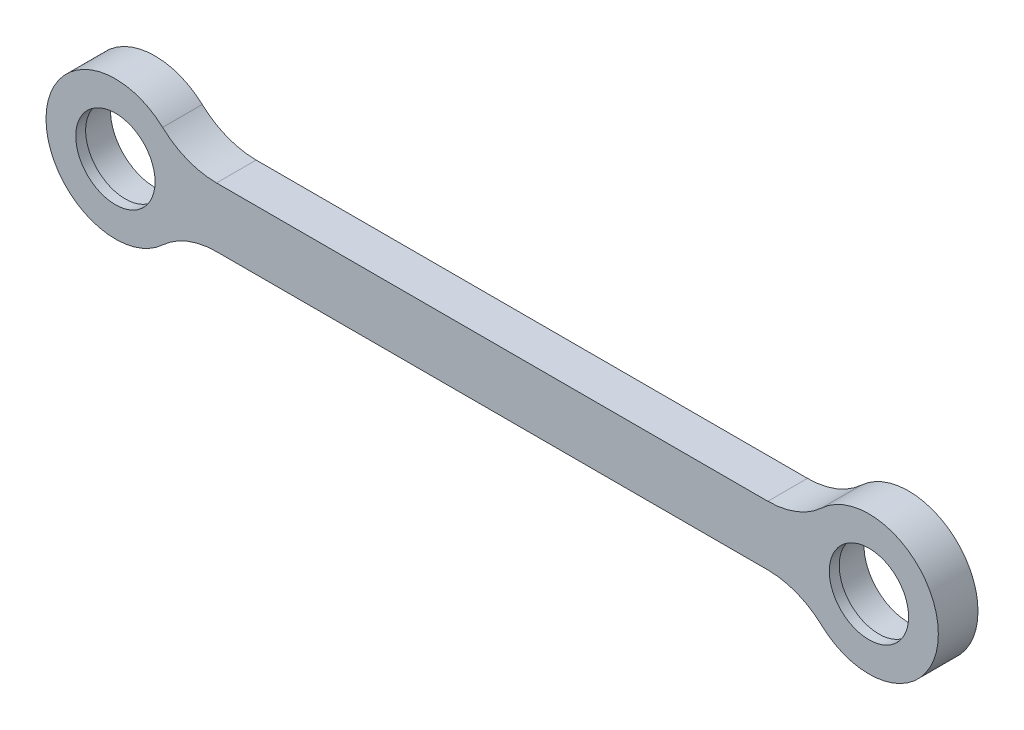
ISO-10303-21;
HEADER;
FILE_DESCRIPTION(('STEP AP214'),'2;1');
FILE_NAME('part.step','',(''),(''),'','','');
FILE_SCHEMA(('AUTOMOTIVE_DESIGN { 1 0 10303 214 1 1 1 1 }'));
ENDSEC;
DATA;
#1=APPLICATION_CONTEXT('core data for automotive mechanical design processes');
#2=APPLICATION_PROTOCOL_DEFINITION('international standard','automotive_design',2000,#1);
#3=PRODUCT_CONTEXT('',#1,'mechanical');
#4=PRODUCT('Part','Part','',(#3));
#5=PRODUCT_RELATED_PRODUCT_CATEGORY('part','',(#4));
#6=PRODUCT_DEFINITION_FORMATION('','',#4);
#7=PRODUCT_DEFINITION_CONTEXT('part definition',#1,'design');
#8=PRODUCT_DEFINITION('design','',#6,#7);
#9=PRODUCT_DEFINITION_SHAPE('','',#8);
#10=(LENGTH_UNIT() NAMED_UNIT(*) SI_UNIT(.MILLI.,.METRE.));
#11=(NAMED_UNIT(*) PLANE_ANGLE_UNIT() SI_UNIT($,.RADIAN.));
#12=(NAMED_UNIT(*) SI_UNIT($,.STERADIAN.) SOLID_ANGLE_UNIT());
#13=UNCERTAINTY_MEASURE_WITH_UNIT(LENGTH_MEASURE(1.E-05),#10,'distance_accuracy_value','');
#14=(GEOMETRIC_REPRESENTATION_CONTEXT(3) GLOBAL_UNCERTAINTY_ASSIGNED_CONTEXT((#13)) GLOBAL_UNIT_ASSIGNED_CONTEXT((#10,
#11,#12)) REPRESENTATION_CONTEXT('',''));
#15=CARTESIAN_POINT('',(0.,0.,0.));
#16=DIRECTION('',(0.,0.,1.));
#17=DIRECTION('',(1.,0.,0.));
#18=AXIS2_PLACEMENT_3D('',#15,#16,#17);
#19=CARTESIAN_POINT('',(0.,0.,0.));
#20=DIRECTION('',(0.,0.,1.));
#21=DIRECTION('',(1.,0.,0.));
#22=AXIS2_PLACEMENT_3D('',#19,#20,#21);
#23=CYLINDRICAL_SURFACE('',#22,4.5);
#24=CARTESIAN_POINT('',(0.,0.,0.));
#25=DIRECTION('',(0.,0.,1.));
#26=DIRECTION('',(1.,0.,0.));
#27=AXIS2_PLACEMENT_3D('',#24,#25,#26);
#28=CIRCLE('',#27,4.5);
#29=CARTESIAN_POINT('',(4.5,0.,0.));
#30=VERTEX_POINT('',#29);
#31=EDGE_CURVE('E228',#30,#30,#28,.T.);
#32=ORIENTED_EDGE('',*,*,#31,.F.);
#33=EDGE_LOOP('',(#32));
#34=FACE_BOUND('',#33,.T.);
#35=CARTESIAN_POINT('',(0.,0.,3.));
#36=DIRECTION('',(0.,0.,1.));
#37=DIRECTION('',(1.,0.,0.));
#38=AXIS2_PLACEMENT_3D('',#35,#36,#37);
#39=CIRCLE('',#38,4.5);
#40=CARTESIAN_POINT('',(4.5,0.,3.));
#41=VERTEX_POINT('',#40);
#42=EDGE_CURVE('E11',#41,#41,#39,.F.);
#43=ORIENTED_EDGE('',*,*,#42,.F.);
#44=EDGE_LOOP('',(#43));
#45=FACE_BOUND('',#44,.T.);
#46=ADVANCED_FACE('F38',(#34,#45),#23,.F.);
#47=CARTESIAN_POINT('',(76.,0.,0.));
#48=DIRECTION('',(0.,0.,1.));
#49=DIRECTION('',(1.,0.,0.));
#50=AXIS2_PLACEMENT_3D('',#47,#48,#49);
#51=CYLINDRICAL_SURFACE('',#50,4.5);
#52=CARTESIAN_POINT('',(76.,0.,0.));
#53=DIRECTION('',(0.,0.,1.));
#54=DIRECTION('',(1.,0.,0.));
#55=AXIS2_PLACEMENT_3D('',#52,#53,#54);
#56=CIRCLE('',#55,4.5);
#57=CARTESIAN_POINT('',(80.5,0.,0.));
#58=VERTEX_POINT('',#57);
#59=EDGE_CURVE('E233',#58,#58,#56,.T.);
#60=ORIENTED_EDGE('',*,*,#59,.F.);
#61=EDGE_LOOP('',(#60));
#62=FACE_BOUND('',#61,.T.);
#63=CARTESIAN_POINT('',(76.,0.,3.));
#64=DIRECTION('',(0.,0.,1.));
#65=DIRECTION('',(1.,0.,0.));
#66=AXIS2_PLACEMENT_3D('',#63,#64,#65);
#67=CIRCLE('',#66,4.5);
#68=CARTESIAN_POINT('',(80.5,0.,3.));
#69=VERTEX_POINT('',#68);
#70=EDGE_CURVE('E46',#69,#69,#67,.F.);
#71=ORIENTED_EDGE('',*,*,#70,.F.);
#72=EDGE_LOOP('',(#71));
#73=FACE_BOUND('',#72,.T.);
#74=ADVANCED_FACE('F167',(#62,#73),#51,.F.);
#75=CARTESIAN_POINT('',(0.,0.,4.));
#76=DIRECTION('',(0.,0.,1.));
#77=DIRECTION('',(1.,0.,0.));
#78=AXIS2_PLACEMENT_3D('',#75,#76,#77);
#79=PLANE('',#78);
#80=DIRECTION('',(-1.,0.,0.));
#81=VECTOR('',#80,1.);
#82=CARTESIAN_POINT('',(6.32455532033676,3.,4.));
#83=LINE('',#82,#81);
#84=CARTESIAN_POINT('',(65.8019609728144,3.,4.));
#85=VERTEX_POINT('',#84);
#86=CARTESIAN_POINT('',(10.1980390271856,3.,4.));
#87=VERTEX_POINT('',#86);
#88=EDGE_CURVE('E123',#85,#87,#83,.T.);
#89=ORIENTED_EDGE('',*,*,#88,.T.);
#90=CARTESIAN_POINT('',(10.1980390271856,11.,4.));
#91=DIRECTION('',(0.,0.,1.));
#92=DIRECTION('',(1.,0.,0.));
#93=AXIS2_PLACEMENT_3D('',#90,#91,#92);
#94=CIRCLE('',#93,8.);
#95=CARTESIAN_POINT('',(4.75908487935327,5.13333333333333,4.));
#96=VERTEX_POINT('',#95);
#97=EDGE_CURVE('E60',#87,#96,#94,.F.);
#98=ORIENTED_EDGE('',*,*,#97,.T.);
#99=CARTESIAN_POINT('',(0.,0.,4.));
#100=DIRECTION('',(0.,0.,1.));
#101=DIRECTION('',(1.,0.,0.));
#102=AXIS2_PLACEMENT_3D('',#99,#100,#101);
#103=CIRCLE('',#102,7.);
#104=CARTESIAN_POINT('',(4.75908487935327,-5.13333333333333,4.));
#105=VERTEX_POINT('',#104);
#106=EDGE_CURVE('E130',#96,#105,#103,.T.);
#107=ORIENTED_EDGE('',*,*,#106,.T.);
#108=CARTESIAN_POINT('',(10.1980390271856,-11.,4.));
#109=DIRECTION('',(0.,0.,1.));
#110=DIRECTION('',(1.,0.,0.));
#111=AXIS2_PLACEMENT_3D('',#108,#109,#110);
#112=CIRCLE('',#111,8.);
#113=CARTESIAN_POINT('',(10.1980390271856,-3.,4.));
#114=VERTEX_POINT('',#113);
#115=EDGE_CURVE('E159',#105,#114,#112,.F.);
#116=ORIENTED_EDGE('',*,*,#115,.T.);
#117=DIRECTION('',(1.,0.,0.));
#118=VECTOR('',#117,1.);
#119=CARTESIAN_POINT('',(6.32455532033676,-3.,4.));
#120=LINE('',#119,#118);
#121=CARTESIAN_POINT('',(65.8019609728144,-3.,4.));
#122=VERTEX_POINT('',#121);
#123=EDGE_CURVE('E133',#114,#122,#120,.T.);
#124=ORIENTED_EDGE('',*,*,#123,.T.);
#125=CARTESIAN_POINT('',(65.8019609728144,-11.,4.));
#126=DIRECTION('',(0.,0.,1.));
#127=DIRECTION('',(1.,0.,0.));
#128=AXIS2_PLACEMENT_3D('',#125,#126,#127);
#129=CIRCLE('',#128,8.);
#130=CARTESIAN_POINT('',(71.2409151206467,-5.13333333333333,4.));
#131=VERTEX_POINT('',#130);
#132=EDGE_CURVE('E155',#122,#131,#129,.F.);
#133=ORIENTED_EDGE('',*,*,#132,.T.);
#134=CARTESIAN_POINT('',(76.,0.,4.));
#135=DIRECTION('',(0.,0.,1.));
#136=DIRECTION('',(1.,0.,0.));
#137=AXIS2_PLACEMENT_3D('',#134,#135,#136);
#138=CIRCLE('',#137,6.99999999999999);
#139=CARTESIAN_POINT('',(71.2409151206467,5.13333333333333,4.));
#140=VERTEX_POINT('',#139);
#141=EDGE_CURVE('E220',#131,#140,#138,.T.);
#142=ORIENTED_EDGE('',*,*,#141,.T.);
#143=CARTESIAN_POINT('',(65.8019609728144,11.,4.));
#144=DIRECTION('',(0.,0.,1.));
#145=DIRECTION('',(1.,0.,0.));
#146=AXIS2_PLACEMENT_3D('',#143,#144,#145);
#147=CIRCLE('',#146,8.);
#148=EDGE_CURVE('E115',#140,#85,#147,.F.);
#149=ORIENTED_EDGE('',*,*,#148,.T.);
#150=EDGE_LOOP('',(#89,#98,#107,#116,#124,#133,#142,#149));
#151=FACE_BOUND('',#150,.T.);
#152=CARTESIAN_POINT('',(76.,0.,4.));
#153=DIRECTION('',(0.,0.,1.));
#154=DIRECTION('',(1.,0.,0.));
#155=AXIS2_PLACEMENT_3D('',#152,#153,#154);
#156=CIRCLE('',#155,4.00000000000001);
#157=CARTESIAN_POINT('',(80.,0.,4.));
#158=VERTEX_POINT('',#157);
#159=EDGE_CURVE('E240',#158,#158,#156,.T.);
#160=ORIENTED_EDGE('',*,*,#159,.F.);
#161=EDGE_LOOP('',(#160));
#162=FACE_BOUND('',#161,.T.);
#163=CARTESIAN_POINT('',(0.,0.,4.));
#164=DIRECTION('',(0.,0.,1.));
#165=DIRECTION('',(1.,0.,0.));
#166=AXIS2_PLACEMENT_3D('',#163,#164,#165);
#167=CIRCLE('',#166,4.);
#168=CARTESIAN_POINT('',(4.,0.,4.));
#169=VERTEX_POINT('',#168);
#170=EDGE_CURVE('E246',#169,#169,#167,.T.);
#171=ORIENTED_EDGE('',*,*,#170,.F.);
#172=EDGE_LOOP('',(#171));
#173=FACE_BOUND('',#172,.T.);
#174=ADVANCED_FACE('F169',(#151,#162,#173),#79,.T.);
#175=CARTESIAN_POINT('',(0.,0.,0.));
#176=DIRECTION('',(0.,0.,1.));
#177=DIRECTION('',(1.,0.,0.));
#178=AXIS2_PLACEMENT_3D('',#175,#176,#177);
#179=PLANE('',#178);
#180=ORIENTED_EDGE('',*,*,#59,.T.);
#181=EDGE_LOOP('',(#180));
#182=FACE_BOUND('',#181,.T.);
#183=ORIENTED_EDGE('',*,*,#31,.T.);
#184=EDGE_LOOP('',(#183));
#185=FACE_BOUND('',#184,.T.);
#186=CARTESIAN_POINT('',(0.,0.,0.));
#187=DIRECTION('',(0.,0.,1.));
#188=DIRECTION('',(1.,0.,0.));
#189=AXIS2_PLACEMENT_3D('',#186,#187,#188);
#190=CIRCLE('',#189,7.);
#191=CARTESIAN_POINT('',(4.75908487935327,5.13333333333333,0.));
#192=VERTEX_POINT('',#191);
#193=CARTESIAN_POINT('',(4.75908487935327,-5.13333333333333,0.));
#194=VERTEX_POINT('',#193);
#195=EDGE_CURVE('E227',#192,#194,#190,.T.);
#196=ORIENTED_EDGE('',*,*,#195,.F.);
#197=CARTESIAN_POINT('',(10.1980390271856,11.,0.));
#198=DIRECTION('',(0.,0.,1.));
#199=DIRECTION('',(1.,0.,0.));
#200=AXIS2_PLACEMENT_3D('',#197,#198,#199);
#201=CIRCLE('',#200,8.);
#202=CARTESIAN_POINT('',(10.1980390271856,3.,0.));
#203=VERTEX_POINT('',#202);
#204=EDGE_CURVE('E129',#192,#203,#201,.T.);
#205=ORIENTED_EDGE('',*,*,#204,.T.);
#206=DIRECTION('',(-1.,0.,0.));
#207=VECTOR('',#206,1.);
#208=CARTESIAN_POINT('',(6.32455532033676,3.,0.));
#209=LINE('',#208,#207);
#210=CARTESIAN_POINT('',(65.8019609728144,3.,0.));
#211=VERTEX_POINT('',#210);
#212=EDGE_CURVE('E121',#211,#203,#209,.T.);
#213=ORIENTED_EDGE('',*,*,#212,.F.);
#214=CARTESIAN_POINT('',(65.8019609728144,11.,0.));
#215=DIRECTION('',(0.,0.,1.));
#216=DIRECTION('',(1.,0.,0.));
#217=AXIS2_PLACEMENT_3D('',#214,#215,#216);
#218=CIRCLE('',#217,8.);
#219=CARTESIAN_POINT('',(71.2409151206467,5.13333333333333,0.));
#220=VERTEX_POINT('',#219);
#221=EDGE_CURVE('E105',#211,#220,#218,.T.);
#222=ORIENTED_EDGE('',*,*,#221,.T.);
#223=CARTESIAN_POINT('',(76.,0.,0.));
#224=DIRECTION('',(0.,0.,1.));
#225=DIRECTION('',(1.,0.,0.));
#226=AXIS2_PLACEMENT_3D('',#223,#224,#225);
#227=CIRCLE('',#226,6.99999999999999);
#228=CARTESIAN_POINT('',(71.2409151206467,-5.13333333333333,0.));
#229=VERTEX_POINT('',#228);
#230=EDGE_CURVE('E131',#229,#220,#227,.T.);
#231=ORIENTED_EDGE('',*,*,#230,.F.);
#232=CARTESIAN_POINT('',(65.8019609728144,-11.,0.));
#233=DIRECTION('',(0.,0.,1.));
#234=DIRECTION('',(1.,0.,0.));
#235=AXIS2_PLACEMENT_3D('',#232,#233,#234);
#236=CIRCLE('',#235,8.);
#237=CARTESIAN_POINT('',(65.8019609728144,-3.,0.));
#238=VERTEX_POINT('',#237);
#239=EDGE_CURVE('E153',#229,#238,#236,.T.);
#240=ORIENTED_EDGE('',*,*,#239,.T.);
#241=DIRECTION('',(1.,0.,0.));
#242=VECTOR('',#241,1.);
#243=CARTESIAN_POINT('',(6.32455532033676,-3.,0.));
#244=LINE('',#243,#242);
#245=CARTESIAN_POINT('',(10.1980390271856,-3.,0.));
#246=VERTEX_POINT('',#245);
#247=EDGE_CURVE('E135',#246,#238,#244,.T.);
#248=ORIENTED_EDGE('',*,*,#247,.F.);
#249=CARTESIAN_POINT('',(10.1980390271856,-11.,0.));
#250=DIRECTION('',(0.,0.,1.));
#251=DIRECTION('',(1.,0.,0.));
#252=AXIS2_PLACEMENT_3D('',#249,#250,#251);
#253=CIRCLE('',#252,8.);
#254=EDGE_CURVE('E157',#246,#194,#253,.T.);
#255=ORIENTED_EDGE('',*,*,#254,.T.);
#256=EDGE_LOOP('',(#196,#205,#213,#222,#231,#240,#248,#255));
#257=FACE_BOUND('',#256,.T.);
#258=ADVANCED_FACE('F128',(#182,#185,#257),#179,.F.);
#259=CARTESIAN_POINT('',(0.,0.,4.));
#260=DIRECTION('',(0.,0.,-1.));
#261=DIRECTION('',(-1.,0.,0.));
#262=AXIS2_PLACEMENT_3D('',#259,#260,#261);
#263=CYLINDRICAL_SURFACE('',#262,7.);
#264=ORIENTED_EDGE('',*,*,#195,.T.);
#265=DIRECTION('',(0.,0.,-1.));
#266=VECTOR('',#265,1.);
#267=CARTESIAN_POINT('',(4.75908487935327,-5.13333333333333,4.));
#268=LINE('',#267,#266);
#269=EDGE_CURVE('E53',#194,#105,#268,.F.);
#270=ORIENTED_EDGE('',*,*,#269,.T.);
#271=ORIENTED_EDGE('',*,*,#106,.F.);
#272=DIRECTION('',(0.,0.,-1.));
#273=VECTOR('',#272,1.);
#274=CARTESIAN_POINT('',(4.75908487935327,5.13333333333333,4.));
#275=LINE('',#274,#273);
#276=EDGE_CURVE('E148',#96,#192,#275,.T.);
#277=ORIENTED_EDGE('',*,*,#276,.T.);
#278=EDGE_LOOP('',(#264,#270,#271,#277));
#279=FACE_BOUND('',#278,.T.);
#280=ADVANCED_FACE('F185',(#279),#263,.T.);
#281=CARTESIAN_POINT('',(6.32455532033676,-3.,4.));
#282=DIRECTION('',(0.,1.,0.));
#283=DIRECTION('',(0.,0.,1.));
#284=AXIS2_PLACEMENT_3D('',#281,#282,#283);
#285=PLANE('',#284);
#286=ORIENTED_EDGE('',*,*,#247,.T.);
#287=DIRECTION('',(0.,0.,1.));
#288=VECTOR('',#287,1.);
#289=CARTESIAN_POINT('',(65.8019609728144,-3.,4.));
#290=LINE('',#289,#288);
#291=EDGE_CURVE('E146',#238,#122,#290,.T.);
#292=ORIENTED_EDGE('',*,*,#291,.T.);
#293=ORIENTED_EDGE('',*,*,#123,.F.);
#294=DIRECTION('',(0.,0.,1.));
#295=VECTOR('',#294,1.);
#296=CARTESIAN_POINT('',(10.1980390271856,-3.,0.));
#297=LINE('',#296,#295);
#298=EDGE_CURVE('E143',#114,#246,#297,.F.);
#299=ORIENTED_EDGE('',*,*,#298,.T.);
#300=EDGE_LOOP('',(#286,#292,#293,#299));
#301=FACE_BOUND('',#300,.T.);
#302=ADVANCED_FACE('F192',(#301),#285,.F.);
#303=CARTESIAN_POINT('',(76.,0.,4.));
#304=DIRECTION('',(0.,0.,-1.));
#305=DIRECTION('',(-1.,0.,0.));
#306=AXIS2_PLACEMENT_3D('',#303,#304,#305);
#307=CYLINDRICAL_SURFACE('',#306,6.99999999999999);
#308=ORIENTED_EDGE('',*,*,#230,.T.);
#309=DIRECTION('',(0.,0.,-1.));
#310=VECTOR('',#309,1.);
#311=CARTESIAN_POINT('',(71.2409151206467,5.13333333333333,4.));
#312=LINE('',#311,#310);
#313=EDGE_CURVE('E110',#220,#140,#312,.F.);
#314=ORIENTED_EDGE('',*,*,#313,.T.);
#315=ORIENTED_EDGE('',*,*,#141,.F.);
#316=DIRECTION('',(0.,0.,-1.));
#317=VECTOR('',#316,1.);
#318=CARTESIAN_POINT('',(71.2409151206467,-5.13333333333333,4.));
#319=LINE('',#318,#317);
#320=EDGE_CURVE('E124',#131,#229,#319,.T.);
#321=ORIENTED_EDGE('',*,*,#320,.T.);
#322=EDGE_LOOP('',(#308,#314,#315,#321));
#323=FACE_BOUND('',#322,.T.);
#324=ADVANCED_FACE('F189',(#323),#307,.T.);
#325=CARTESIAN_POINT('',(6.32455532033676,3.,4.));
#326=DIRECTION('',(0.,-1.,0.));
#327=DIRECTION('',(0.,0.,-1.));
#328=AXIS2_PLACEMENT_3D('',#325,#326,#327);
#329=PLANE('',#328);
#330=ORIENTED_EDGE('',*,*,#88,.F.);
#331=DIRECTION('',(0.,0.,1.));
#332=VECTOR('',#331,1.);
#333=CARTESIAN_POINT('',(65.8019609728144,3.,0.));
#334=LINE('',#333,#332);
#335=EDGE_CURVE('E109',#85,#211,#334,.F.);
#336=ORIENTED_EDGE('',*,*,#335,.T.);
#337=ORIENTED_EDGE('',*,*,#212,.T.);
#338=DIRECTION('',(0.,0.,1.));
#339=VECTOR('',#338,1.);
#340=CARTESIAN_POINT('',(10.1980390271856,3.,4.));
#341=LINE('',#340,#339);
#342=EDGE_CURVE('E125',#203,#87,#341,.T.);
#343=ORIENTED_EDGE('',*,*,#342,.T.);
#344=EDGE_LOOP('',(#330,#336,#337,#343));
#345=FACE_BOUND('',#344,.T.);
#346=ADVANCED_FACE('F120',(#345),#329,.F.);
#347=CARTESIAN_POINT('',(65.8019609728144,11.,4.));
#348=DIRECTION('',(0.,0.,-1.));
#349=DIRECTION('',(-1.,0.,0.));
#350=AXIS2_PLACEMENT_3D('',#347,#348,#349);
#351=CYLINDRICAL_SURFACE('',#350,8.);
#352=ORIENTED_EDGE('',*,*,#148,.F.);
#353=ORIENTED_EDGE('',*,*,#313,.F.);
#354=ORIENTED_EDGE('',*,*,#221,.F.);
#355=ORIENTED_EDGE('',*,*,#335,.F.);
#356=EDGE_LOOP('',(#352,#353,#354,#355));
#357=FACE_BOUND('',#356,.T.);
#358=ADVANCED_FACE('F108',(#357),#351,.F.);
#359=CARTESIAN_POINT('',(65.8019609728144,-11.,4.));
#360=DIRECTION('',(0.,0.,-1.));
#361=DIRECTION('',(-1.,0.,0.));
#362=AXIS2_PLACEMENT_3D('',#359,#360,#361);
#363=CYLINDRICAL_SURFACE('',#362,8.);
#364=ORIENTED_EDGE('',*,*,#132,.F.);
#365=ORIENTED_EDGE('',*,*,#291,.F.);
#366=ORIENTED_EDGE('',*,*,#239,.F.);
#367=ORIENTED_EDGE('',*,*,#320,.F.);
#368=EDGE_LOOP('',(#364,#365,#366,#367));
#369=FACE_BOUND('',#368,.T.);
#370=ADVANCED_FACE('F201',(#369),#363,.F.);
#371=CARTESIAN_POINT('',(10.1980390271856,-11.,4.));
#372=DIRECTION('',(0.,0.,-1.));
#373=DIRECTION('',(-1.,0.,0.));
#374=AXIS2_PLACEMENT_3D('',#371,#372,#373);
#375=CYLINDRICAL_SURFACE('',#374,8.);
#376=ORIENTED_EDGE('',*,*,#115,.F.);
#377=ORIENTED_EDGE('',*,*,#269,.F.);
#378=ORIENTED_EDGE('',*,*,#254,.F.);
#379=ORIENTED_EDGE('',*,*,#298,.F.);
#380=EDGE_LOOP('',(#376,#377,#378,#379));
#381=FACE_BOUND('',#380,.T.);
#382=ADVANCED_FACE('F203',(#381),#375,.F.);
#383=CARTESIAN_POINT('',(10.1980390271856,11.,4.));
#384=DIRECTION('',(0.,0.,-1.));
#385=DIRECTION('',(-1.,0.,0.));
#386=AXIS2_PLACEMENT_3D('',#383,#384,#385);
#387=CYLINDRICAL_SURFACE('',#386,8.);
#388=ORIENTED_EDGE('',*,*,#97,.F.);
#389=ORIENTED_EDGE('',*,*,#342,.F.);
#390=ORIENTED_EDGE('',*,*,#204,.F.);
#391=ORIENTED_EDGE('',*,*,#276,.F.);
#392=EDGE_LOOP('',(#388,#389,#390,#391));
#393=FACE_BOUND('',#392,.T.);
#394=ADVANCED_FACE('F40',(#393),#387,.F.);
#395=CARTESIAN_POINT('',(76.,0.,3.));
#396=DIRECTION('',(0.,0.,1.));
#397=DIRECTION('',(1.,0.,0.));
#398=AXIS2_PLACEMENT_3D('',#395,#396,#397);
#399=PLANE('',#398);
#400=CARTESIAN_POINT('',(76.,0.,3.));
#401=DIRECTION('',(0.,0.,1.));
#402=DIRECTION('',(1.,0.,0.));
#403=AXIS2_PLACEMENT_3D('',#400,#401,#402);
#404=CIRCLE('',#403,4.00000000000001);
#405=CARTESIAN_POINT('',(80.,0.,3.));
#406=VERTEX_POINT('',#405);
#407=EDGE_CURVE('E237',#406,#406,#404,.T.);
#408=ORIENTED_EDGE('',*,*,#407,.T.);
#409=EDGE_LOOP('',(#408));
#410=FACE_BOUND('',#409,.T.);
#411=ORIENTED_EDGE('',*,*,#70,.T.);
#412=EDGE_LOOP('',(#411));
#413=FACE_BOUND('',#412,.T.);
#414=ADVANCED_FACE('F165',(#410,#413),#399,.F.);
#415=CARTESIAN_POINT('',(76.,0.,3.));
#416=DIRECTION('',(0.,0.,1.));
#417=DIRECTION('',(1.,0.,0.));
#418=AXIS2_PLACEMENT_3D('',#415,#416,#417);
#419=CYLINDRICAL_SURFACE('',#418,4.00000000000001);
#420=ORIENTED_EDGE('',*,*,#407,.F.);
#421=EDGE_LOOP('',(#420));
#422=FACE_BOUND('',#421,.T.);
#423=ORIENTED_EDGE('',*,*,#159,.T.);
#424=EDGE_LOOP('',(#423));
#425=FACE_BOUND('',#424,.T.);
#426=ADVANCED_FACE('F264',(#422,#425),#419,.F.);
#427=CARTESIAN_POINT('',(0.,0.,3.));
#428=DIRECTION('',(0.,0.,1.));
#429=DIRECTION('',(1.,0.,0.));
#430=AXIS2_PLACEMENT_3D('',#427,#428,#429);
#431=PLANE('',#430);
#432=CARTESIAN_POINT('',(0.,0.,3.));
#433=DIRECTION('',(0.,0.,1.));
#434=DIRECTION('',(1.,0.,0.));
#435=AXIS2_PLACEMENT_3D('',#432,#433,#434);
#436=CIRCLE('',#435,4.);
#437=CARTESIAN_POINT('',(4.,0.,3.));
#438=VERTEX_POINT('',#437);
#439=EDGE_CURVE('E243',#438,#438,#436,.T.);
#440=ORIENTED_EDGE('',*,*,#439,.T.);
#441=EDGE_LOOP('',(#440));
#442=FACE_BOUND('',#441,.T.);
#443=ORIENTED_EDGE('',*,*,#42,.T.);
#444=EDGE_LOOP('',(#443));
#445=FACE_BOUND('',#444,.T.);
#446=ADVANCED_FACE('F252',(#442,#445),#431,.F.);
#447=CARTESIAN_POINT('',(0.,0.,3.));
#448=DIRECTION('',(0.,0.,1.));
#449=DIRECTION('',(1.,0.,0.));
#450=AXIS2_PLACEMENT_3D('',#447,#448,#449);
#451=CYLINDRICAL_SURFACE('',#450,4.);
#452=ORIENTED_EDGE('',*,*,#439,.F.);
#453=EDGE_LOOP('',(#452));
#454=FACE_BOUND('',#453,.T.);
#455=ORIENTED_EDGE('',*,*,#170,.T.);
#456=EDGE_LOOP('',(#455));
#457=FACE_BOUND('',#456,.T.);
#458=ADVANCED_FACE('F255',(#454,#457),#451,.F.);
#459=CLOSED_SHELL('',(#46,#74,#174,#258,#280,#302,#324,#346,#358,#370,#382,#394,#414,#426,#446,#458));
#460=MANIFOLD_SOLID_BREP('B2',#459);
#461=ADVANCED_BREP_SHAPE_REPRESENTATION('',(#18,#460),#14);
#462=SHAPE_DEFINITION_REPRESENTATION(#9,#461);
ENDSEC;
END-ISO-10303-21;
